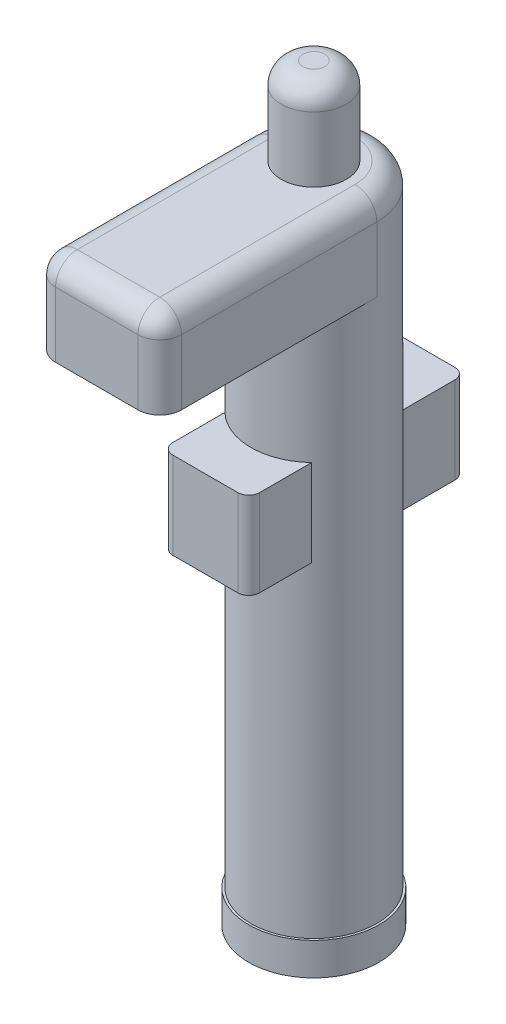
ISO-10303-21;
HEADER;
FILE_DESCRIPTION(('STEP AP214'),'2;1');
FILE_NAME('part.step','',(''),(''),'','','');
FILE_SCHEMA(('AUTOMOTIVE_DESIGN { 1 0 10303 214 1 1 1 1 }'));
ENDSEC;
DATA;
#1=APPLICATION_CONTEXT('core data for automotive mechanical design processes');
#2=APPLICATION_PROTOCOL_DEFINITION('international standard','automotive_design',2000,#1);
#3=PRODUCT_CONTEXT('',#1,'mechanical');
#4=PRODUCT('Part','Part','',(#3));
#5=PRODUCT_RELATED_PRODUCT_CATEGORY('part','',(#4));
#6=PRODUCT_DEFINITION_FORMATION('','',#4);
#7=PRODUCT_DEFINITION_CONTEXT('part definition',#1,'design');
#8=PRODUCT_DEFINITION('design','',#6,#7);
#9=PRODUCT_DEFINITION_SHAPE('','',#8);
#10=(LENGTH_UNIT() NAMED_UNIT(*) SI_UNIT(.MILLI.,.METRE.));
#11=(NAMED_UNIT(*) PLANE_ANGLE_UNIT() SI_UNIT($,.RADIAN.));
#12=(NAMED_UNIT(*) SI_UNIT($,.STERADIAN.) SOLID_ANGLE_UNIT());
#13=UNCERTAINTY_MEASURE_WITH_UNIT(LENGTH_MEASURE(1.E-05),#10,'distance_accuracy_value','');
#14=(GEOMETRIC_REPRESENTATION_CONTEXT(3) GLOBAL_UNCERTAINTY_ASSIGNED_CONTEXT((#13)) GLOBAL_UNIT_ASSIGNED_CONTEXT((#10,
#11,#12)) REPRESENTATION_CONTEXT('',''));
#15=CARTESIAN_POINT('',(0.,0.,0.));
#16=DIRECTION('',(0.,0.,1.));
#17=DIRECTION('',(1.,0.,0.));
#18=AXIS2_PLACEMENT_3D('',#15,#16,#17);
#19=CARTESIAN_POINT('',(0.,25.,0.));
#20=DIRECTION('',(0.,-1.,0.));
#21=DIRECTION('',(0.,0.,-1.));
#22=AXIS2_PLACEMENT_3D('',#19,#20,#21);
#23=CYLINDRICAL_SURFACE('',#22,2.9);
#24=CARTESIAN_POINT('',(0.,15.,0.));
#25=DIRECTION('',(0.,-1.,0.));
#26=DIRECTION('',(0.,0.,-1.));
#27=AXIS2_PLACEMENT_3D('',#24,#25,#26);
#28=CIRCLE('',#27,2.9);
#29=CARTESIAN_POINT('',(2.,15.,2.1));
#30=VERTEX_POINT('',#29);
#31=CARTESIAN_POINT('',(-2.,15.,2.1));
#32=VERTEX_POINT('',#31);
#33=EDGE_CURVE('E172',#30,#32,#28,.T.);
#34=ORIENTED_EDGE('',*,*,#33,.T.);
#35=DIRECTION('',(0.,-1.,0.));
#36=VECTOR('',#35,1.);
#37=CARTESIAN_POINT('',(-2.,25.,2.1));
#38=LINE('',#37,#36);
#39=CARTESIAN_POINT('',(-2.,19.,2.1));
#40=VERTEX_POINT('',#39);
#41=EDGE_CURVE('E194',#32,#40,#38,.F.);
#42=ORIENTED_EDGE('',*,*,#41,.T.);
#43=CARTESIAN_POINT('',(0.,19.,0.));
#44=DIRECTION('',(0.,1.,0.));
#45=DIRECTION('',(0.,0.,1.));
#46=AXIS2_PLACEMENT_3D('',#43,#44,#45);
#47=CIRCLE('',#46,2.9);
#48=CARTESIAN_POINT('',(2.,19.,2.1));
#49=VERTEX_POINT('',#48);
#50=EDGE_CURVE('E192',#40,#49,#47,.T.);
#51=ORIENTED_EDGE('',*,*,#50,.T.);
#52=DIRECTION('',(0.,-1.,0.));
#53=VECTOR('',#52,1.);
#54=CARTESIAN_POINT('',(2.,25.,2.1));
#55=LINE('',#54,#53);
#56=EDGE_CURVE('E181',#49,#30,#55,.T.);
#57=ORIENTED_EDGE('',*,*,#56,.T.);
#58=EDGE_LOOP('',(#34,#42,#51,#57));
#59=FACE_BOUND('',#58,.T.);
#60=CARTESIAN_POINT('',(2.,19.,-2.1));
#61=VERTEX_POINT('',#60);
#62=CARTESIAN_POINT('',(-2.,19.,-2.1));
#63=VERTEX_POINT('',#62);
#64=EDGE_CURVE('E196',#61,#63,#47,.T.);
#65=ORIENTED_EDGE('',*,*,#64,.T.);
#66=DIRECTION('',(0.,-1.,0.));
#67=VECTOR('',#66,1.);
#68=CARTESIAN_POINT('',(-2.,25.,-2.1));
#69=LINE('',#68,#67);
#70=CARTESIAN_POINT('',(-2.,15.,-2.1));
#71=VERTEX_POINT('',#70);
#72=EDGE_CURVE('E182',#63,#71,#69,.T.);
#73=ORIENTED_EDGE('',*,*,#72,.T.);
#74=CARTESIAN_POINT('',(2.,15.,-2.1));
#75=VERTEX_POINT('',#74);
#76=EDGE_CURVE('E184',#71,#75,#28,.T.);
#77=ORIENTED_EDGE('',*,*,#76,.T.);
#78=DIRECTION('',(0.,-1.,0.));
#79=VECTOR('',#78,1.);
#80=CARTESIAN_POINT('',(2.,25.,-2.1));
#81=LINE('',#80,#79);
#82=EDGE_CURVE('E421',#75,#61,#81,.F.);
#83=ORIENTED_EDGE('',*,*,#82,.T.);
#84=EDGE_LOOP('',(#65,#73,#77,#83));
#85=FACE_BOUND('',#84,.T.);
#86=CARTESIAN_POINT('',(0.,0.,0.));
#87=DIRECTION('',(0.,1.,0.));
#88=DIRECTION('',(0.,0.,1.));
#89=AXIS2_PLACEMENT_3D('',#86,#87,#88);
#90=CIRCLE('',#89,2.9);
#91=CARTESIAN_POINT('',(0.,0.,2.9));
#92=VERTEX_POINT('',#91);
#93=EDGE_CURVE('E367',#92,#92,#90,.T.);
#94=ORIENTED_EDGE('',*,*,#93,.T.);
#95=EDGE_LOOP('',(#94));
#96=FACE_BOUND('',#95,.T.);
#97=DIRECTION('',(0.,-1.,0.));
#98=VECTOR('',#97,1.);
#99=CARTESIAN_POINT('',(-2.9,29.,0.));
#100=LINE('',#99,#98);
#101=CARTESIAN_POINT('',(-2.9,28.,0.));
#102=VERTEX_POINT('',#101);
#103=CARTESIAN_POINT('',(-2.9,25.,0.));
#104=VERTEX_POINT('',#103);
#105=EDGE_CURVE('E361',#102,#104,#100,.T.);
#106=ORIENTED_EDGE('',*,*,#105,.F.);
#107=CARTESIAN_POINT('',(0.,28.,0.));
#108=DIRECTION('',(0.,1.,0.));
#109=DIRECTION('',(0.,0.,1.));
#110=AXIS2_PLACEMENT_3D('',#107,#108,#109);
#111=CIRCLE('',#110,2.9);
#112=CARTESIAN_POINT('',(2.9,28.,0.));
#113=VERTEX_POINT('',#112);
#114=EDGE_CURVE('E379',#102,#113,#111,.F.);
#115=ORIENTED_EDGE('',*,*,#114,.T.);
#116=DIRECTION('',(0.,-1.,0.));
#117=VECTOR('',#116,1.);
#118=CARTESIAN_POINT('',(2.9,29.,0.));
#119=LINE('',#118,#117);
#120=CARTESIAN_POINT('',(2.9,25.,0.));
#121=VERTEX_POINT('',#120);
#122=EDGE_CURVE('E363',#113,#121,#119,.T.);
#123=ORIENTED_EDGE('',*,*,#122,.T.);
#124=CARTESIAN_POINT('',(0.,25.,0.));
#125=DIRECTION('',(0.,-1.,0.));
#126=DIRECTION('',(0.,0.,1.));
#127=AXIS2_PLACEMENT_3D('',#124,#125,#126);
#128=CIRCLE('',#127,2.9);
#129=EDGE_CURVE('E351',#121,#104,#128,.T.);
#130=ORIENTED_EDGE('',*,*,#129,.T.);
#131=EDGE_LOOP('',(#106,#115,#123,#130));
#132=FACE_BOUND('',#131,.T.);
#133=ADVANCED_FACE('F35',(#59,#85,#96,#132),#23,.T.);
#134=CARTESIAN_POINT('',(0.,29.,0.));
#135=DIRECTION('',(0.,1.,0.));
#136=DIRECTION('',(0.,0.,1.));
#137=AXIS2_PLACEMENT_3D('',#134,#135,#136);
#138=PLANE('',#137);
#139=CARTESIAN_POINT('',(0.,29.,0.));
#140=DIRECTION('',(0.,1.,0.));
#141=DIRECTION('',(0.,0.,1.));
#142=AXIS2_PLACEMENT_3D('',#139,#140,#141);
#143=CIRCLE('',#142,1.5);
#144=CARTESIAN_POINT('',(0.,29.,1.5));
#145=VERTEX_POINT('',#144);
#146=EDGE_CURVE('E336',#145,#145,#143,.T.);
#147=ORIENTED_EDGE('',*,*,#146,.F.);
#148=EDGE_LOOP('',(#147));
#149=FACE_BOUND('',#148,.T.);
#150=DIRECTION('',(0.,0.,-1.));
#151=VECTOR('',#150,1.);
#152=CARTESIAN_POINT('',(1.9,29.,0.));
#153=LINE('',#152,#151);
#154=CARTESIAN_POINT('',(1.9,29.,9.));
#155=VERTEX_POINT('',#154);
#156=CARTESIAN_POINT('',(1.9,29.,0.));
#157=VERTEX_POINT('',#156);
#158=EDGE_CURVE('E374',#155,#157,#153,.T.);
#159=ORIENTED_EDGE('',*,*,#158,.T.);
#160=CARTESIAN_POINT('',(0.,29.,0.));
#161=DIRECTION('',(0.,1.,0.));
#162=DIRECTION('',(0.,0.,1.));
#163=AXIS2_PLACEMENT_3D('',#160,#161,#162);
#164=CIRCLE('',#163,1.9);
#165=CARTESIAN_POINT('',(-1.9,29.,0.));
#166=VERTEX_POINT('',#165);
#167=EDGE_CURVE('E376',#157,#166,#164,.T.);
#168=ORIENTED_EDGE('',*,*,#167,.T.);
#169=DIRECTION('',(0.,0.,1.));
#170=VECTOR('',#169,1.);
#171=CARTESIAN_POINT('',(-1.9,29.,10.));
#172=LINE('',#171,#170);
#173=CARTESIAN_POINT('',(-1.9,29.,9.));
#174=VERTEX_POINT('',#173);
#175=EDGE_CURVE('E372',#166,#174,#172,.T.);
#176=ORIENTED_EDGE('',*,*,#175,.T.);
#177=DIRECTION('',(1.,0.,0.));
#178=VECTOR('',#177,1.);
#179=CARTESIAN_POINT('',(2.9,29.,9.));
#180=LINE('',#179,#178);
#181=EDGE_CURVE('E366',#174,#155,#180,.T.);
#182=ORIENTED_EDGE('',*,*,#181,.T.);
#183=EDGE_LOOP('',(#159,#168,#176,#182));
#184=FACE_BOUND('',#183,.T.);
#185=ADVANCED_FACE('F252',(#149,#184),#138,.T.);
#186=CARTESIAN_POINT('',(2.9,29.,0.));
#187=DIRECTION('',(-1.,0.,0.));
#188=DIRECTION('',(0.,0.,1.));
#189=AXIS2_PLACEMENT_3D('',#186,#187,#188);
#190=PLANE('',#189);
#191=ORIENTED_EDGE('',*,*,#122,.F.);
#192=DIRECTION('',(0.,0.,-1.));
#193=VECTOR('',#192,1.);
#194=CARTESIAN_POINT('',(2.9,28.,10.));
#195=LINE('',#194,#193);
#196=CARTESIAN_POINT('',(2.9,28.,9.));
#197=VERTEX_POINT('',#196);
#198=EDGE_CURVE('E384',#113,#197,#195,.F.);
#199=ORIENTED_EDGE('',*,*,#198,.T.);
#200=DIRECTION('',(0.,-1.,0.));
#201=VECTOR('',#200,1.);
#202=CARTESIAN_POINT('',(2.9,29.,9.));
#203=LINE('',#202,#201);
#204=CARTESIAN_POINT('',(2.9,25.,9.));
#205=VERTEX_POINT('',#204);
#206=EDGE_CURVE('E382',#197,#205,#203,.T.);
#207=ORIENTED_EDGE('',*,*,#206,.T.);
#208=DIRECTION('',(0.,0.,-1.));
#209=VECTOR('',#208,1.);
#210=CARTESIAN_POINT('',(2.9,25.,0.));
#211=LINE('',#210,#209);
#212=EDGE_CURVE('E349',#205,#121,#211,.T.);
#213=ORIENTED_EDGE('',*,*,#212,.T.);
#214=EDGE_LOOP('',(#191,#199,#207,#213));
#215=FACE_BOUND('',#214,.T.);
#216=ADVANCED_FACE('F257',(#215),#190,.F.);
#217=CARTESIAN_POINT('',(-2.9,29.,0.));
#218=DIRECTION('',(1.,0.,0.));
#219=DIRECTION('',(0.,0.,-1.));
#220=AXIS2_PLACEMENT_3D('',#217,#218,#219);
#221=PLANE('',#220);
#222=DIRECTION('',(0.,-1.,0.));
#223=VECTOR('',#222,1.);
#224=CARTESIAN_POINT('',(-2.9,29.,9.));
#225=LINE('',#224,#223);
#226=CARTESIAN_POINT('',(-2.9,25.,9.));
#227=VERTEX_POINT('',#226);
#228=CARTESIAN_POINT('',(-2.9,28.,9.));
#229=VERTEX_POINT('',#228);
#230=EDGE_CURVE('E386',#227,#229,#225,.F.);
#231=ORIENTED_EDGE('',*,*,#230,.T.);
#232=DIRECTION('',(0.,0.,1.));
#233=VECTOR('',#232,1.);
#234=CARTESIAN_POINT('',(-2.9,28.,0.));
#235=LINE('',#234,#233);
#236=EDGE_CURVE('E388',#229,#102,#235,.F.);
#237=ORIENTED_EDGE('',*,*,#236,.T.);
#238=ORIENTED_EDGE('',*,*,#105,.T.);
#239=DIRECTION('',(0.,0.,1.));
#240=VECTOR('',#239,1.);
#241=CARTESIAN_POINT('',(-2.9,25.,0.));
#242=LINE('',#241,#240);
#243=EDGE_CURVE('E355',#104,#227,#242,.T.);
#244=ORIENTED_EDGE('',*,*,#243,.T.);
#245=EDGE_LOOP('',(#231,#237,#238,#244));
#246=FACE_BOUND('',#245,.T.);
#247=ADVANCED_FACE('F472',(#246),#221,.F.);
#248=CARTESIAN_POINT('',(-2.9,29.,10.));
#249=DIRECTION('',(0.,0.,-1.));
#250=DIRECTION('',(-1.,0.,0.));
#251=AXIS2_PLACEMENT_3D('',#248,#249,#250);
#252=PLANE('',#251);
#253=DIRECTION('',(1.,0.,0.));
#254=VECTOR('',#253,1.);
#255=CARTESIAN_POINT('',(-2.9,28.,10.));
#256=LINE('',#255,#254);
#257=CARTESIAN_POINT('',(1.9,28.,10.));
#258=VERTEX_POINT('',#257);
#259=CARTESIAN_POINT('',(-1.9,28.,10.));
#260=VERTEX_POINT('',#259);
#261=EDGE_CURVE('E390',#258,#260,#256,.F.);
#262=ORIENTED_EDGE('',*,*,#261,.T.);
#263=DIRECTION('',(0.,-1.,0.));
#264=VECTOR('',#263,1.);
#265=CARTESIAN_POINT('',(-1.9,29.,10.));
#266=LINE('',#265,#264);
#267=CARTESIAN_POINT('',(-1.9,25.,10.));
#268=VERTEX_POINT('',#267);
#269=EDGE_CURVE('E394',#260,#268,#266,.T.);
#270=ORIENTED_EDGE('',*,*,#269,.T.);
#271=DIRECTION('',(1.,0.,0.));
#272=VECTOR('',#271,1.);
#273=CARTESIAN_POINT('',(-2.9,25.,10.));
#274=LINE('',#273,#272);
#275=CARTESIAN_POINT('',(1.9,25.,10.));
#276=VERTEX_POINT('',#275);
#277=EDGE_CURVE('E358',#268,#276,#274,.T.);
#278=ORIENTED_EDGE('',*,*,#277,.T.);
#279=DIRECTION('',(0.,-1.,0.));
#280=VECTOR('',#279,1.);
#281=CARTESIAN_POINT('',(1.9,29.,10.));
#282=LINE('',#281,#280);
#283=EDGE_CURVE('E392',#276,#258,#282,.F.);
#284=ORIENTED_EDGE('',*,*,#283,.T.);
#285=EDGE_LOOP('',(#262,#270,#278,#284));
#286=FACE_BOUND('',#285,.T.);
#287=ADVANCED_FACE('F468',(#286),#252,.F.);
#288=CARTESIAN_POINT('',(0.,25.,0.));
#289=DIRECTION('',(0.,1.,0.));
#290=DIRECTION('',(0.,0.,1.));
#291=AXIS2_PLACEMENT_3D('',#288,#289,#290);
#292=PLANE('',#291);
#293=ORIENTED_EDGE('',*,*,#277,.F.);
#294=CARTESIAN_POINT('',(-1.9,25.,9.));
#295=DIRECTION('',(0.,1.,0.));
#296=DIRECTION('',(0.,0.,1.));
#297=AXIS2_PLACEMENT_3D('',#294,#295,#296);
#298=CIRCLE('',#297,1.);
#299=EDGE_CURVE('E398',#268,#227,#298,.F.);
#300=ORIENTED_EDGE('',*,*,#299,.T.);
#301=ORIENTED_EDGE('',*,*,#243,.F.);
#302=ORIENTED_EDGE('',*,*,#129,.F.);
#303=ORIENTED_EDGE('',*,*,#212,.F.);
#304=CARTESIAN_POINT('',(1.9,25.,9.));
#305=DIRECTION('',(0.,1.,0.));
#306=DIRECTION('',(0.,0.,1.));
#307=AXIS2_PLACEMENT_3D('',#304,#305,#306);
#308=CIRCLE('',#307,1.);
#309=EDGE_CURVE('E396',#205,#276,#308,.F.);
#310=ORIENTED_EDGE('',*,*,#309,.T.);
#311=EDGE_LOOP('',(#293,#300,#301,#302,#303,#310));
#312=FACE_BOUND('',#311,.T.);
#313=ADVANCED_FACE('F294',(#312),#292,.F.);
#314=CARTESIAN_POINT('',(1.9,29.,9.));
#315=DIRECTION('',(0.,-1.,0.));
#316=DIRECTION('',(0.,0.,-1.));
#317=AXIS2_PLACEMENT_3D('',#314,#315,#316);
#318=CYLINDRICAL_SURFACE('',#317,1.);
#319=ORIENTED_EDGE('',*,*,#309,.F.);
#320=ORIENTED_EDGE('',*,*,#206,.F.);
#321=CARTESIAN_POINT('',(1.9,28.,9.));
#322=DIRECTION('',(0.,1.,0.));
#323=DIRECTION('',(0.,0.,1.));
#324=AXIS2_PLACEMENT_3D('',#321,#322,#323);
#325=CIRCLE('',#324,1.);
#326=EDGE_CURVE('E352',#258,#197,#325,.T.);
#327=ORIENTED_EDGE('',*,*,#326,.F.);
#328=ORIENTED_EDGE('',*,*,#283,.F.);
#329=EDGE_LOOP('',(#319,#320,#327,#328));
#330=FACE_BOUND('',#329,.T.);
#331=ADVANCED_FACE('F290',(#330),#318,.T.);
#332=CARTESIAN_POINT('',(0.,28.,9.));
#333=DIRECTION('',(-1.,0.,0.));
#334=DIRECTION('',(0.,0.,1.));
#335=AXIS2_PLACEMENT_3D('',#332,#333,#334);
#336=CYLINDRICAL_SURFACE('',#335,1.);
#337=CARTESIAN_POINT('',(-1.9,28.,9.));
#338=DIRECTION('',(-1.,0.,0.));
#339=DIRECTION('',(0.,0.,1.));
#340=AXIS2_PLACEMENT_3D('',#337,#338,#339);
#341=CIRCLE('',#340,1.);
#342=EDGE_CURVE('E412',#260,#174,#341,.T.);
#343=ORIENTED_EDGE('',*,*,#342,.F.);
#344=ORIENTED_EDGE('',*,*,#261,.F.);
#345=CARTESIAN_POINT('',(1.9,28.,9.));
#346=DIRECTION('',(1.,0.,0.));
#347=DIRECTION('',(0.,0.,-1.));
#348=AXIS2_PLACEMENT_3D('',#345,#346,#347);
#349=CIRCLE('',#348,1.);
#350=EDGE_CURVE('E415',#155,#258,#349,.T.);
#351=ORIENTED_EDGE('',*,*,#350,.F.);
#352=ORIENTED_EDGE('',*,*,#181,.F.);
#353=EDGE_LOOP('',(#343,#344,#351,#352));
#354=FACE_BOUND('',#353,.T.);
#355=ADVANCED_FACE('F286',(#354),#336,.T.);
#356=CARTESIAN_POINT('',(-1.9,29.,9.));
#357=DIRECTION('',(0.,-1.,0.));
#358=DIRECTION('',(0.,0.,-1.));
#359=AXIS2_PLACEMENT_3D('',#356,#357,#358);
#360=CYLINDRICAL_SURFACE('',#359,1.);
#361=ORIENTED_EDGE('',*,*,#299,.F.);
#362=ORIENTED_EDGE('',*,*,#269,.F.);
#363=CARTESIAN_POINT('',(-1.9,28.,9.));
#364=DIRECTION('',(0.,1.,0.));
#365=DIRECTION('',(0.,0.,1.));
#366=AXIS2_PLACEMENT_3D('',#363,#364,#365);
#367=CIRCLE('',#366,1.);
#368=EDGE_CURVE('E409',#229,#260,#367,.T.);
#369=ORIENTED_EDGE('',*,*,#368,.F.);
#370=ORIENTED_EDGE('',*,*,#230,.F.);
#371=EDGE_LOOP('',(#361,#362,#369,#370));
#372=FACE_BOUND('',#371,.T.);
#373=ADVANCED_FACE('F282',(#372),#360,.T.);
#374=CARTESIAN_POINT('',(1.9,28.,9.));
#375=DIRECTION('',(0.,0.,1.));
#376=DIRECTION('',(1.,0.,0.));
#377=AXIS2_PLACEMENT_3D('',#374,#375,#376);
#378=SPHERICAL_SURFACE('',#377,1.);
#379=ORIENTED_EDGE('',*,*,#350,.T.);
#380=ORIENTED_EDGE('',*,*,#326,.T.);
#381=CARTESIAN_POINT('',(1.9,28.,9.));
#382=DIRECTION('',(0.,0.,1.));
#383=DIRECTION('',(1.,0.,0.));
#384=AXIS2_PLACEMENT_3D('',#381,#382,#383);
#385=CIRCLE('',#384,1.);
#386=EDGE_CURVE('E406',#155,#197,#385,.F.);
#387=ORIENTED_EDGE('',*,*,#386,.F.);
#388=EDGE_LOOP('',(#379,#380,#387));
#389=FACE_BOUND('',#388,.T.);
#390=ADVANCED_FACE('F278',(#389),#378,.T.);
#391=CARTESIAN_POINT('',(-1.9,28.,9.));
#392=DIRECTION('',(0.,0.,1.));
#393=DIRECTION('',(1.,0.,0.));
#394=AXIS2_PLACEMENT_3D('',#391,#392,#393);
#395=SPHERICAL_SURFACE('',#394,1.);
#396=ORIENTED_EDGE('',*,*,#368,.T.);
#397=ORIENTED_EDGE('',*,*,#342,.T.);
#398=CARTESIAN_POINT('',(-1.9,28.,9.));
#399=DIRECTION('',(0.,0.,1.));
#400=DIRECTION('',(1.,0.,0.));
#401=AXIS2_PLACEMENT_3D('',#398,#399,#400);
#402=CIRCLE('',#401,1.);
#403=EDGE_CURVE('E403',#229,#174,#402,.F.);
#404=ORIENTED_EDGE('',*,*,#403,.F.);
#405=EDGE_LOOP('',(#396,#397,#404));
#406=FACE_BOUND('',#405,.T.);
#407=ADVANCED_FACE('F274',(#406),#395,.T.);
#408=CARTESIAN_POINT('',(1.9,28.,0.));
#409=DIRECTION('',(0.,0.,1.));
#410=DIRECTION('',(1.,0.,0.));
#411=AXIS2_PLACEMENT_3D('',#408,#409,#410);
#412=CYLINDRICAL_SURFACE('',#411,1.);
#413=ORIENTED_EDGE('',*,*,#386,.T.);
#414=ORIENTED_EDGE('',*,*,#198,.F.);
#415=CARTESIAN_POINT('',(1.9,28.,0.));
#416=DIRECTION('',(0.,0.,-1.));
#417=DIRECTION('',(-1.,0.,0.));
#418=AXIS2_PLACEMENT_3D('',#415,#416,#417);
#419=CIRCLE('',#418,1.);
#420=EDGE_CURVE('E401',#157,#113,#419,.T.);
#421=ORIENTED_EDGE('',*,*,#420,.F.);
#422=ORIENTED_EDGE('',*,*,#158,.F.);
#423=EDGE_LOOP('',(#413,#414,#421,#422));
#424=FACE_BOUND('',#423,.T.);
#425=ADVANCED_FACE('F270',(#424),#412,.T.);
#426=CARTESIAN_POINT('',(-1.9,28.,0.));
#427=DIRECTION('',(0.,0.,-1.));
#428=DIRECTION('',(-1.,0.,0.));
#429=AXIS2_PLACEMENT_3D('',#426,#427,#428);
#430=CYLINDRICAL_SURFACE('',#429,1.);
#431=ORIENTED_EDGE('',*,*,#403,.T.);
#432=ORIENTED_EDGE('',*,*,#175,.F.);
#433=CARTESIAN_POINT('',(-1.9,28.,0.));
#434=DIRECTION('',(0.,0.,-1.));
#435=DIRECTION('',(0.,1.,0.));
#436=AXIS2_PLACEMENT_3D('',#433,#434,#435);
#437=CIRCLE('',#436,1.);
#438=EDGE_CURVE('E344',#102,#166,#437,.T.);
#439=ORIENTED_EDGE('',*,*,#438,.F.);
#440=ORIENTED_EDGE('',*,*,#236,.F.);
#441=EDGE_LOOP('',(#431,#432,#439,#440));
#442=FACE_BOUND('',#441,.T.);
#443=ADVANCED_FACE('F266',(#442),#430,.T.);
#444=CARTESIAN_POINT('',(0.,28.,0.));
#445=DIRECTION('',(0.,1.,0.));
#446=DIRECTION('',(0.,0.,1.));
#447=AXIS2_PLACEMENT_3D('',#444,#445,#446);
#448=TOROIDAL_SURFACE('',#447,1.9,1.);
#449=ORIENTED_EDGE('',*,*,#420,.T.);
#450=ORIENTED_EDGE('',*,*,#114,.F.);
#451=ORIENTED_EDGE('',*,*,#438,.T.);
#452=ORIENTED_EDGE('',*,*,#167,.F.);
#453=EDGE_LOOP('',(#449,#450,#451,#452));
#454=FACE_BOUND('',#453,.T.);
#455=ADVANCED_FACE('F262',(#454),#448,.T.);
#456=CARTESIAN_POINT('',(0.,0.,-5.));
#457=DIRECTION('',(0.,0.,-1.));
#458=DIRECTION('',(-1.,0.,0.));
#459=AXIS2_PLACEMENT_3D('',#456,#457,#458);
#460=PLANE('',#459);
#461=DIRECTION('',(1.,0.,0.));
#462=VECTOR('',#461,1.);
#463=CARTESIAN_POINT('',(2.,15.,-5.));
#464=LINE('',#463,#462);
#465=CARTESIAN_POINT('',(-1.5,15.,-5.));
#466=VERTEX_POINT('',#465);
#467=CARTESIAN_POINT('',(1.5,15.,-5.));
#468=VERTEX_POINT('',#467);
#469=EDGE_CURVE('E330',#466,#468,#464,.T.);
#470=ORIENTED_EDGE('',*,*,#469,.F.);
#471=DIRECTION('',(0.,-1.,0.));
#472=VECTOR('',#471,1.);
#473=CARTESIAN_POINT('',(-1.5,0.,-5.));
#474=LINE('',#473,#472);
#475=CARTESIAN_POINT('',(-1.5,19.,-5.));
#476=VERTEX_POINT('',#475);
#477=EDGE_CURVE('E209',#466,#476,#474,.F.);
#478=ORIENTED_EDGE('',*,*,#477,.T.);
#479=DIRECTION('',(-1.,0.,0.));
#480=VECTOR('',#479,1.);
#481=CARTESIAN_POINT('',(2.,19.,-5.));
#482=LINE('',#481,#480);
#483=CARTESIAN_POINT('',(1.5,19.,-5.));
#484=VERTEX_POINT('',#483);
#485=EDGE_CURVE('E334',#484,#476,#482,.T.);
#486=ORIENTED_EDGE('',*,*,#485,.F.);
#487=DIRECTION('',(0.,1.,0.));
#488=VECTOR('',#487,1.);
#489=CARTESIAN_POINT('',(1.5,0.,-5.));
#490=LINE('',#489,#488);
#491=EDGE_CURVE('E207',#484,#468,#490,.F.);
#492=ORIENTED_EDGE('',*,*,#491,.T.);
#493=EDGE_LOOP('',(#470,#478,#486,#492));
#494=FACE_BOUND('',#493,.T.);
#495=ADVANCED_FACE('F265',(#494),#460,.T.);
#496=CARTESIAN_POINT('',(2.,15.,-5.));
#497=DIRECTION('',(0.,-1.,0.));
#498=DIRECTION('',(0.,0.,-1.));
#499=AXIS2_PLACEMENT_3D('',#496,#497,#498);
#500=PLANE('',#499);
#501=DIRECTION('',(0.,0.,1.));
#502=VECTOR('',#501,1.);
#503=CARTESIAN_POINT('',(-2.,15.,-5.));
#504=LINE('',#503,#502);
#505=CARTESIAN_POINT('',(-2.,15.,-4.5));
#506=VERTEX_POINT('',#505);
#507=EDGE_CURVE('E188',#506,#71,#504,.T.);
#508=ORIENTED_EDGE('',*,*,#507,.F.);
#509=CARTESIAN_POINT('',(-1.5,15.,-4.5));
#510=DIRECTION('',(0.,-1.,0.));
#511=DIRECTION('',(0.,0.,-1.));
#512=AXIS2_PLACEMENT_3D('',#509,#510,#511);
#513=CIRCLE('',#512,0.5);
#514=EDGE_CURVE('E205',#506,#466,#513,.T.);
#515=ORIENTED_EDGE('',*,*,#514,.T.);
#516=ORIENTED_EDGE('',*,*,#469,.T.);
#517=CARTESIAN_POINT('',(1.5,15.,-4.5));
#518=DIRECTION('',(0.,-1.,0.));
#519=DIRECTION('',(0.,0.,-1.));
#520=AXIS2_PLACEMENT_3D('',#517,#518,#519);
#521=CIRCLE('',#520,0.5);
#522=CARTESIAN_POINT('',(2.,15.,-4.5));
#523=VERTEX_POINT('',#522);
#524=EDGE_CURVE('E203',#468,#523,#521,.T.);
#525=ORIENTED_EDGE('',*,*,#524,.T.);
#526=DIRECTION('',(0.,0.,1.));
#527=VECTOR('',#526,1.);
#528=CARTESIAN_POINT('',(2.,15.,-5.));
#529=LINE('',#528,#527);
#530=EDGE_CURVE('E187',#523,#75,#529,.T.);
#531=ORIENTED_EDGE('',*,*,#530,.T.);
#532=ORIENTED_EDGE('',*,*,#76,.F.);
#533=EDGE_LOOP('',(#508,#515,#516,#525,#531,#532));
#534=FACE_BOUND('',#533,.T.);
#535=ADVANCED_FACE('F435',(#534),#500,.T.);
#536=CARTESIAN_POINT('',(2.,19.,-5.));
#537=DIRECTION('',(1.,0.,0.));
#538=DIRECTION('',(0.,1.,0.));
#539=AXIS2_PLACEMENT_3D('',#536,#537,#538);
#540=PLANE('',#539);
#541=ORIENTED_EDGE('',*,*,#530,.F.);
#542=DIRECTION('',(0.,1.,0.));
#543=VECTOR('',#542,1.);
#544=CARTESIAN_POINT('',(2.,19.,-4.5));
#545=LINE('',#544,#543);
#546=CARTESIAN_POINT('',(2.,19.,-4.5));
#547=VERTEX_POINT('',#546);
#548=EDGE_CURVE('E215',#523,#547,#545,.T.);
#549=ORIENTED_EDGE('',*,*,#548,.T.);
#550=DIRECTION('',(0.,0.,1.));
#551=VECTOR('',#550,1.);
#552=CARTESIAN_POINT('',(2.,19.,-5.));
#553=LINE('',#552,#551);
#554=EDGE_CURVE('E345',#547,#61,#553,.T.);
#555=ORIENTED_EDGE('',*,*,#554,.T.);
#556=ORIENTED_EDGE('',*,*,#82,.F.);
#557=EDGE_LOOP('',(#541,#549,#555,#556));
#558=FACE_BOUND('',#557,.T.);
#559=ADVANCED_FACE('F441',(#558),#540,.T.);
#560=CARTESIAN_POINT('',(2.,19.,-5.));
#561=DIRECTION('',(0.,1.,0.));
#562=DIRECTION('',(0.,0.,1.));
#563=AXIS2_PLACEMENT_3D('',#560,#561,#562);
#564=PLANE('',#563);
#565=ORIENTED_EDGE('',*,*,#485,.T.);
#566=CARTESIAN_POINT('',(-1.5,19.,-4.5));
#567=DIRECTION('',(0.,1.,0.));
#568=DIRECTION('',(0.,0.,1.));
#569=AXIS2_PLACEMENT_3D('',#566,#567,#568);
#570=CIRCLE('',#569,0.5);
#571=CARTESIAN_POINT('',(-2.,19.,-4.5));
#572=VERTEX_POINT('',#571);
#573=EDGE_CURVE('E213',#476,#572,#570,.T.);
#574=ORIENTED_EDGE('',*,*,#573,.T.);
#575=DIRECTION('',(0.,0.,1.));
#576=VECTOR('',#575,1.);
#577=CARTESIAN_POINT('',(-2.,19.,-5.));
#578=LINE('',#577,#576);
#579=EDGE_CURVE('E342',#572,#63,#578,.T.);
#580=ORIENTED_EDGE('',*,*,#579,.T.);
#581=ORIENTED_EDGE('',*,*,#64,.F.);
#582=ORIENTED_EDGE('',*,*,#554,.F.);
#583=CARTESIAN_POINT('',(1.5,19.,-4.5));
#584=DIRECTION('',(0.,1.,0.));
#585=DIRECTION('',(0.,0.,1.));
#586=AXIS2_PLACEMENT_3D('',#583,#584,#585);
#587=CIRCLE('',#586,0.5);
#588=EDGE_CURVE('E211',#547,#484,#587,.T.);
#589=ORIENTED_EDGE('',*,*,#588,.T.);
#590=EDGE_LOOP('',(#565,#574,#580,#581,#582,#589));
#591=FACE_BOUND('',#590,.T.);
#592=ADVANCED_FACE('F444',(#591),#564,.T.);
#593=CARTESIAN_POINT('',(-2.,19.,-5.));
#594=DIRECTION('',(-1.,0.,0.));
#595=DIRECTION('',(0.,0.,1.));
#596=AXIS2_PLACEMENT_3D('',#593,#594,#595);
#597=PLANE('',#596);
#598=ORIENTED_EDGE('',*,*,#579,.F.);
#599=DIRECTION('',(0.,-1.,0.));
#600=VECTOR('',#599,1.);
#601=CARTESIAN_POINT('',(-2.,19.,-4.5));
#602=LINE('',#601,#600);
#603=EDGE_CURVE('E200',#572,#506,#602,.T.);
#604=ORIENTED_EDGE('',*,*,#603,.T.);
#605=ORIENTED_EDGE('',*,*,#507,.T.);
#606=ORIENTED_EDGE('',*,*,#72,.F.);
#607=EDGE_LOOP('',(#598,#604,#605,#606));
#608=FACE_BOUND('',#607,.T.);
#609=ADVANCED_FACE('F431',(#608),#597,.T.);
#610=CARTESIAN_POINT('',(-2.,15.,4.5));
#611=VERTEX_POINT('',#610);
#612=EDGE_CURVE('E176',#32,#611,#504,.T.);
#613=ORIENTED_EDGE('',*,*,#612,.T.);
#614=DIRECTION('',(0.,-1.,0.));
#615=VECTOR('',#614,1.);
#616=CARTESIAN_POINT('',(-2.,19.,4.5));
#617=LINE('',#616,#615);
#618=CARTESIAN_POINT('',(-2.,19.,4.5));
#619=VERTEX_POINT('',#618);
#620=EDGE_CURVE('E232',#611,#619,#617,.F.);
#621=ORIENTED_EDGE('',*,*,#620,.T.);
#622=EDGE_CURVE('E326',#40,#619,#578,.T.);
#623=ORIENTED_EDGE('',*,*,#622,.F.);
#624=ORIENTED_EDGE('',*,*,#41,.F.);
#625=EDGE_LOOP('',(#613,#621,#623,#624));
#626=FACE_BOUND('',#625,.T.);
#627=ADVANCED_FACE('F462',(#626),#597,.T.);
#628=CARTESIAN_POINT('',(2.,19.,4.5));
#629=VERTEX_POINT('',#628);
#630=EDGE_CURVE('E346',#49,#629,#553,.T.);
#631=ORIENTED_EDGE('',*,*,#630,.T.);
#632=DIRECTION('',(0.,1.,0.));
#633=VECTOR('',#632,1.);
#634=CARTESIAN_POINT('',(2.,15.,4.5));
#635=LINE('',#634,#633);
#636=CARTESIAN_POINT('',(2.,15.,4.5));
#637=VERTEX_POINT('',#636);
#638=EDGE_CURVE('E58',#629,#637,#635,.F.);
#639=ORIENTED_EDGE('',*,*,#638,.T.);
#640=EDGE_CURVE('E174',#30,#637,#529,.T.);
#641=ORIENTED_EDGE('',*,*,#640,.F.);
#642=ORIENTED_EDGE('',*,*,#56,.F.);
#643=EDGE_LOOP('',(#631,#639,#641,#642));
#644=FACE_BOUND('',#643,.T.);
#645=ADVANCED_FACE('F185',(#644),#540,.T.);
#646=ORIENTED_EDGE('',*,*,#640,.T.);
#647=CARTESIAN_POINT('',(1.5,15.,4.5));
#648=DIRECTION('',(0.,-1.,0.));
#649=DIRECTION('',(0.,0.,-1.));
#650=AXIS2_PLACEMENT_3D('',#647,#648,#649);
#651=CIRCLE('',#650,0.5);
#652=CARTESIAN_POINT('',(1.5,15.,5.));
#653=VERTEX_POINT('',#652);
#654=EDGE_CURVE('E230',#637,#653,#651,.T.);
#655=ORIENTED_EDGE('',*,*,#654,.T.);
#656=DIRECTION('',(1.,0.,0.));
#657=VECTOR('',#656,1.);
#658=CARTESIAN_POINT('',(2.,15.,5.));
#659=LINE('',#658,#657);
#660=CARTESIAN_POINT('',(-1.5,15.,5.));
#661=VERTEX_POINT('',#660);
#662=EDGE_CURVE('E331',#661,#653,#659,.T.);
#663=ORIENTED_EDGE('',*,*,#662,.F.);
#664=CARTESIAN_POINT('',(-1.5,15.,4.5));
#665=DIRECTION('',(0.,-1.,0.));
#666=DIRECTION('',(0.,0.,-1.));
#667=AXIS2_PLACEMENT_3D('',#664,#665,#666);
#668=CIRCLE('',#667,0.5);
#669=EDGE_CURVE('E50',#661,#611,#668,.T.);
#670=ORIENTED_EDGE('',*,*,#669,.T.);
#671=ORIENTED_EDGE('',*,*,#612,.F.);
#672=ORIENTED_EDGE('',*,*,#33,.F.);
#673=EDGE_LOOP('',(#646,#655,#663,#670,#671,#672));
#674=FACE_BOUND('',#673,.T.);
#675=ADVANCED_FACE('F173',(#674),#500,.T.);
#676=DIRECTION('',(-1.,0.,0.));
#677=VECTOR('',#676,1.);
#678=CARTESIAN_POINT('',(2.,19.,5.));
#679=LINE('',#678,#677);
#680=CARTESIAN_POINT('',(1.5,19.,5.));
#681=VERTEX_POINT('',#680);
#682=CARTESIAN_POINT('',(-1.5,19.,5.));
#683=VERTEX_POINT('',#682);
#684=EDGE_CURVE('E324',#681,#683,#679,.T.);
#685=ORIENTED_EDGE('',*,*,#684,.F.);
#686=CARTESIAN_POINT('',(1.5,19.,4.5));
#687=DIRECTION('',(0.,1.,0.));
#688=DIRECTION('',(0.,0.,1.));
#689=AXIS2_PLACEMENT_3D('',#686,#687,#688);
#690=CIRCLE('',#689,0.5);
#691=EDGE_CURVE('E226',#681,#629,#690,.T.);
#692=ORIENTED_EDGE('',*,*,#691,.T.);
#693=ORIENTED_EDGE('',*,*,#630,.F.);
#694=ORIENTED_EDGE('',*,*,#50,.F.);
#695=ORIENTED_EDGE('',*,*,#622,.T.);
#696=CARTESIAN_POINT('',(-1.5,19.,4.5));
#697=DIRECTION('',(0.,1.,0.));
#698=DIRECTION('',(0.,0.,1.));
#699=AXIS2_PLACEMENT_3D('',#696,#697,#698);
#700=CIRCLE('',#699,0.5);
#701=EDGE_CURVE('E224',#619,#683,#700,.T.);
#702=ORIENTED_EDGE('',*,*,#701,.T.);
#703=EDGE_LOOP('',(#685,#692,#693,#694,#695,#702));
#704=FACE_BOUND('',#703,.T.);
#705=ADVANCED_FACE('F323',(#704),#564,.T.);
#706=CARTESIAN_POINT('',(0.,0.,5.));
#707=DIRECTION('',(0.,0.,-1.));
#708=DIRECTION('',(-1.,0.,0.));
#709=AXIS2_PLACEMENT_3D('',#706,#707,#708);
#710=PLANE('',#709);
#711=ORIENTED_EDGE('',*,*,#662,.T.);
#712=DIRECTION('',(0.,1.,0.));
#713=VECTOR('',#712,1.);
#714=CARTESIAN_POINT('',(1.5,19.,5.));
#715=LINE('',#714,#713);
#716=EDGE_CURVE('E221',#653,#681,#715,.T.);
#717=ORIENTED_EDGE('',*,*,#716,.T.);
#718=ORIENTED_EDGE('',*,*,#684,.T.);
#719=DIRECTION('',(0.,-1.,0.));
#720=VECTOR('',#719,1.);
#721=CARTESIAN_POINT('',(-1.5,15.,5.));
#722=LINE('',#721,#720);
#723=EDGE_CURVE('E218',#683,#661,#722,.T.);
#724=ORIENTED_EDGE('',*,*,#723,.T.);
#725=EDGE_LOOP('',(#711,#717,#718,#724));
#726=FACE_BOUND('',#725,.T.);
#727=ADVANCED_FACE('F300',(#726),#710,.F.);
#728=CARTESIAN_POINT('',(-1.5,19.,-4.5));
#729=DIRECTION('',(0.,-1.,0.));
#730=DIRECTION('',(0.,0.,-1.));
#731=AXIS2_PLACEMENT_3D('',#728,#729,#730);
#732=CYLINDRICAL_SURFACE('',#731,0.5);
#733=ORIENTED_EDGE('',*,*,#573,.F.);
#734=ORIENTED_EDGE('',*,*,#477,.F.);
#735=ORIENTED_EDGE('',*,*,#514,.F.);
#736=ORIENTED_EDGE('',*,*,#603,.F.);
#737=EDGE_LOOP('',(#733,#734,#735,#736));
#738=FACE_BOUND('',#737,.T.);
#739=ADVANCED_FACE('F296',(#738),#732,.T.);
#740=CARTESIAN_POINT('',(1.5,19.,-4.5));
#741=DIRECTION('',(0.,1.,0.));
#742=DIRECTION('',(-1.,0.,0.));
#743=AXIS2_PLACEMENT_3D('',#740,#741,#742);
#744=CYLINDRICAL_SURFACE('',#743,0.5);
#745=ORIENTED_EDGE('',*,*,#524,.F.);
#746=ORIENTED_EDGE('',*,*,#491,.F.);
#747=ORIENTED_EDGE('',*,*,#588,.F.);
#748=ORIENTED_EDGE('',*,*,#548,.F.);
#749=EDGE_LOOP('',(#745,#746,#747,#748));
#750=FACE_BOUND('',#749,.T.);
#751=ADVANCED_FACE('F299',(#750),#744,.T.);
#752=CARTESIAN_POINT('',(1.5,0.,4.5));
#753=DIRECTION('',(0.,-1.,0.));
#754=DIRECTION('',(1.,0.,0.));
#755=AXIS2_PLACEMENT_3D('',#752,#753,#754);
#756=CYLINDRICAL_SURFACE('',#755,0.5);
#757=ORIENTED_EDGE('',*,*,#654,.F.);
#758=ORIENTED_EDGE('',*,*,#638,.F.);
#759=ORIENTED_EDGE('',*,*,#691,.F.);
#760=ORIENTED_EDGE('',*,*,#716,.F.);
#761=EDGE_LOOP('',(#757,#758,#759,#760));
#762=FACE_BOUND('',#761,.T.);
#763=ADVANCED_FACE('F304',(#762),#756,.T.);
#764=CARTESIAN_POINT('',(-1.5,0.,4.5));
#765=DIRECTION('',(0.,1.,0.));
#766=DIRECTION('',(0.,0.,1.));
#767=AXIS2_PLACEMENT_3D('',#764,#765,#766);
#768=CYLINDRICAL_SURFACE('',#767,0.5);
#769=ORIENTED_EDGE('',*,*,#701,.F.);
#770=ORIENTED_EDGE('',*,*,#620,.F.);
#771=ORIENTED_EDGE('',*,*,#669,.F.);
#772=ORIENTED_EDGE('',*,*,#723,.F.);
#773=EDGE_LOOP('',(#769,#770,#771,#772));
#774=FACE_BOUND('',#773,.T.);
#775=ADVANCED_FACE('F307',(#774),#768,.T.);
#776=CARTESIAN_POINT('',(0.,33.,0.));
#777=DIRECTION('',(0.,-1.,0.));
#778=DIRECTION('',(0.,0.,-1.));
#779=AXIS2_PLACEMENT_3D('',#776,#777,#778);
#780=CYLINDRICAL_SURFACE('',#779,1.5);
#781=CARTESIAN_POINT('',(0.,32.,0.));
#782=DIRECTION('',(0.,1.,0.));
#783=DIRECTION('',(0.,0.,1.));
#784=AXIS2_PLACEMENT_3D('',#781,#782,#783);
#785=CIRCLE('',#784,1.5);
#786=CARTESIAN_POINT('',(0.,32.,1.5));
#787=VERTEX_POINT('',#786);
#788=EDGE_CURVE('E11',#787,#787,#785,.F.);
#789=ORIENTED_EDGE('',*,*,#788,.T.);
#790=EDGE_LOOP('',(#789));
#791=FACE_BOUND('',#790,.T.);
#792=ORIENTED_EDGE('',*,*,#146,.T.);
#793=EDGE_LOOP('',(#792));
#794=FACE_BOUND('',#793,.T.);
#795=ADVANCED_FACE('F248',(#791,#794),#780,.T.);
#796=CARTESIAN_POINT('',(0.,33.,0.));
#797=DIRECTION('',(0.,1.,0.));
#798=DIRECTION('',(0.,0.,1.));
#799=AXIS2_PLACEMENT_3D('',#796,#797,#798);
#800=PLANE('',#799);
#801=CARTESIAN_POINT('',(0.,33.,0.));
#802=DIRECTION('',(0.,1.,0.));
#803=DIRECTION('',(0.,0.,1.));
#804=AXIS2_PLACEMENT_3D('',#801,#802,#803);
#805=CIRCLE('',#804,0.5);
#806=CARTESIAN_POINT('',(0.,33.,0.5));
#807=VERTEX_POINT('',#806);
#808=EDGE_CURVE('E43',#807,#807,#805,.T.);
#809=ORIENTED_EDGE('',*,*,#808,.T.);
#810=EDGE_LOOP('',(#809));
#811=FACE_BOUND('',#810,.T.);
#812=ADVANCED_FACE('F236',(#811),#800,.T.);
#813=CARTESIAN_POINT('',(0.,32.,0.));
#814=DIRECTION('',(0.,1.,0.));
#815=DIRECTION('',(0.,0.,1.));
#816=AXIS2_PLACEMENT_3D('',#813,#814,#815);
#817=DEGENERATE_TOROIDAL_SURFACE('',#816,0.5,1.,.T.);
#818=ORIENTED_EDGE('',*,*,#788,.F.);
#819=EDGE_LOOP('',(#818));
#820=FACE_BOUND('',#819,.T.);
#821=ORIENTED_EDGE('',*,*,#808,.F.);
#822=EDGE_LOOP('',(#821));
#823=FACE_BOUND('',#822,.T.);
#824=ADVANCED_FACE('F37',(#820,#823),#817,.T.);
#825=CARTESIAN_POINT('',(0.,-1.5,0.));
#826=DIRECTION('',(0.,1.,0.));
#827=DIRECTION('',(0.,0.,1.));
#828=AXIS2_PLACEMENT_3D('',#825,#826,#827);
#829=CYLINDRICAL_SURFACE('',#828,3.);
#830=CARTESIAN_POINT('',(0.,-1.5,0.));
#831=DIRECTION('',(0.,-1.,0.));
#832=DIRECTION('',(0.,0.,-1.));
#833=AXIS2_PLACEMENT_3D('',#830,#831,#832);
#834=CIRCLE('',#833,3.);
#835=CARTESIAN_POINT('',(0.,-1.5,-3.));
#836=VERTEX_POINT('',#835);
#837=EDGE_CURVE('E370',#836,#836,#834,.T.);
#838=ORIENTED_EDGE('',*,*,#837,.F.);
#839=EDGE_LOOP('',(#838));
#840=FACE_BOUND('',#839,.T.);
#841=CARTESIAN_POINT('',(0.,0.,0.));
#842=DIRECTION('',(0.,-1.,0.));
#843=DIRECTION('',(0.,0.,-1.));
#844=AXIS2_PLACEMENT_3D('',#841,#842,#843);
#845=CIRCLE('',#844,3.);
#846=CARTESIAN_POINT('',(0.,0.,-3.));
#847=VERTEX_POINT('',#846);
#848=EDGE_CURVE('E701',#847,#847,#845,.T.);
#849=ORIENTED_EDGE('',*,*,#848,.T.);
#850=EDGE_LOOP('',(#849));
#851=FACE_BOUND('',#850,.T.);
#852=ADVANCED_FACE('F239',(#840,#851),#829,.T.);
#853=CARTESIAN_POINT('',(0.,-1.5,0.));
#854=DIRECTION('',(0.,-1.,0.));
#855=DIRECTION('',(0.,0.,-1.));
#856=AXIS2_PLACEMENT_3D('',#853,#854,#855);
#857=PLANE('',#856);
#858=ORIENTED_EDGE('',*,*,#837,.T.);
#859=EDGE_LOOP('',(#858));
#860=FACE_BOUND('',#859,.T.);
#861=ADVANCED_FACE('F245',(#860),#857,.T.);
#862=CARTESIAN_POINT('',(0.,0.,0.));
#863=DIRECTION('',(0.,-1.,0.));
#864=DIRECTION('',(0.,0.,-1.));
#865=AXIS2_PLACEMENT_3D('',#862,#863,#864);
#866=PLANE('',#865);
#867=ORIENTED_EDGE('',*,*,#93,.F.);
#868=EDGE_LOOP('',(#867));
#869=FACE_BOUND('',#868,.T.);
#870=ORIENTED_EDGE('',*,*,#848,.F.);
#871=EDGE_LOOP('',(#870));
#872=FACE_BOUND('',#871,.T.);
#873=ADVANCED_FACE('F683',(#869,#872),#866,.F.);
#874=CLOSED_SHELL('',(#133,#185,#216,#247,#287,#313,#331,#355,#373,#390,#407,#425,#443,#455,
#495,#535,#559,#592,#609,#627,#645,#675,#705,#727,#739,#751,#763,#775,#795,#812,#824,#852,#861,#873));
#875=MANIFOLD_SOLID_BREP('B2',#874);
#876=ADVANCED_BREP_SHAPE_REPRESENTATION('',(#18,#875),#14);
#877=SHAPE_DEFINITION_REPRESENTATION(#9,#876);
ENDSEC;
END-ISO-10303-21;
